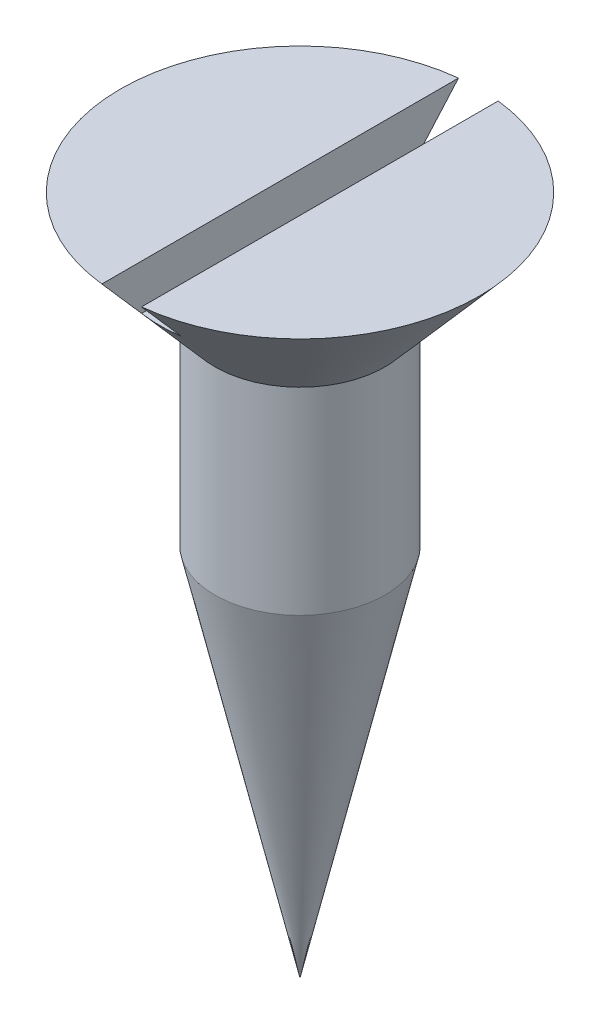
ISO-10303-21;
HEADER;
FILE_DESCRIPTION(('STEP AP214'),'2;1');
FILE_NAME('part.step','',(''),(''),'','','');
FILE_SCHEMA(('AUTOMOTIVE_DESIGN { 1 0 10303 214 1 1 1 1 }'));
ENDSEC;
DATA;
#1=APPLICATION_CONTEXT('core data for automotive mechanical design processes');
#2=APPLICATION_PROTOCOL_DEFINITION('international standard','automotive_design',2000,#1);
#3=PRODUCT_CONTEXT('',#1,'mechanical');
#4=PRODUCT('Part','Part','',(#3));
#5=PRODUCT_RELATED_PRODUCT_CATEGORY('part','',(#4));
#6=PRODUCT_DEFINITION_FORMATION('','',#4);
#7=PRODUCT_DEFINITION_CONTEXT('part definition',#1,'design');
#8=PRODUCT_DEFINITION('design','',#6,#7);
#9=PRODUCT_DEFINITION_SHAPE('','',#8);
#10=(LENGTH_UNIT() NAMED_UNIT(*) SI_UNIT(.MILLI.,.METRE.));
#11=(NAMED_UNIT(*) PLANE_ANGLE_UNIT() SI_UNIT($,.RADIAN.));
#12=(NAMED_UNIT(*) SI_UNIT($,.STERADIAN.) SOLID_ANGLE_UNIT());
#13=UNCERTAINTY_MEASURE_WITH_UNIT(LENGTH_MEASURE(1.E-05),#10,'distance_accuracy_value','');
#14=(GEOMETRIC_REPRESENTATION_CONTEXT(3) GLOBAL_UNCERTAINTY_ASSIGNED_CONTEXT((#13)) GLOBAL_UNIT_ASSIGNED_CONTEXT((#10,
#11,#12)) REPRESENTATION_CONTEXT('',''));
#15=CARTESIAN_POINT('',(0.,0.,0.));
#16=DIRECTION('',(0.,0.,1.));
#17=DIRECTION('',(1.,0.,0.));
#18=AXIS2_PLACEMENT_3D('',#15,#16,#17);
#19=CARTESIAN_POINT('',(-4.01955,0.,0.));
#20=DIRECTION('',(0.,1.,0.));
#21=DIRECTION('',(-1.,0.,0.));
#22=AXIS2_PLACEMENT_3D('',#19,#20,#21);
#23=PLANE('',#22);
#24=DIRECTION('',(0.,0.,-1.));
#25=VECTOR('',#24,1.);
#26=CARTESIAN_POINT('',(0.4445,0.,0.));
#27=LINE('',#26,#25);
#28=CARTESIAN_POINT('',(0.4445,0.,3.99489698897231));
#29=VERTEX_POINT('',#28);
#30=CARTESIAN_POINT('',(0.4445,0.,-3.99489698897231));
#31=VERTEX_POINT('',#30);
#32=EDGE_CURVE('E133',#29,#31,#27,.T.);
#33=ORIENTED_EDGE('',*,*,#32,.F.);
#34=CARTESIAN_POINT('',(0.,0.,0.));
#35=DIRECTION('',(0.,1.,0.));
#36=DIRECTION('',(-1.,0.,0.));
#37=AXIS2_PLACEMENT_3D('',#34,#35,#36);
#38=CIRCLE('',#37,4.01955);
#39=EDGE_CURVE('E134',#29,#31,#38,.T.);
#40=ORIENTED_EDGE('',*,*,#39,.T.);
#41=EDGE_LOOP('',(#33,#40));
#42=FACE_BOUND('',#41,.T.);
#43=ADVANCED_FACE('F32',(#42),#23,.T.);
#44=DIRECTION('',(0.,0.,1.));
#45=VECTOR('',#44,1.);
#46=CARTESIAN_POINT('',(-0.4445,0.,0.));
#47=LINE('',#46,#45);
#48=CARTESIAN_POINT('',(-0.4445,0.,-3.99489698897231));
#49=VERTEX_POINT('',#48);
#50=CARTESIAN_POINT('',(-0.4445,0.,3.99489698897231));
#51=VERTEX_POINT('',#50);
#52=EDGE_CURVE('E80',#49,#51,#47,.T.);
#53=ORIENTED_EDGE('',*,*,#52,.F.);
#54=EDGE_CURVE('E136',#49,#51,#38,.T.);
#55=ORIENTED_EDGE('',*,*,#54,.T.);
#56=EDGE_LOOP('',(#53,#55));
#57=FACE_BOUND('',#56,.T.);
#58=ADVANCED_FACE('F34',(#57),#23,.T.);
#59=CARTESIAN_POINT('',(0.,-6.858,0.));
#60=DIRECTION('',(0.,1.,0.));
#61=DIRECTION('',(-1.,0.,0.));
#62=AXIS2_PLACEMENT_3D('',#59,#60,#61);
#63=CONICAL_SURFACE('',#62,1.905,0.223476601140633);
#64=CARTESIAN_POINT('',(0.,-15.24,0.));
#65=VERTEX_POINT('',#64);
#66=VERTEX_LOOP('',#65);
#67=FACE_BOUND('',#66,.T.);
#68=CARTESIAN_POINT('',(0.,-6.858,0.));
#69=DIRECTION('',(0.,1.,0.));
#70=DIRECTION('',(-1.,0.,0.));
#71=AXIS2_PLACEMENT_3D('',#68,#69,#70);
#72=CIRCLE('',#71,1.905);
#73=CARTESIAN_POINT('',(-1.905,-6.858,0.));
#74=VERTEX_POINT('',#73);
#75=EDGE_CURVE('E100',#74,#74,#72,.T.);
#76=ORIENTED_EDGE('',*,*,#75,.F.);
#77=EDGE_LOOP('',(#76));
#78=FACE_BOUND('',#77,.T.);
#79=ADVANCED_FACE('F129',(#67,#78),#63,.T.);
#80=CARTESIAN_POINT('',(0.,0.,0.));
#81=DIRECTION('',(0.,1.,0.));
#82=DIRECTION('',(-1.,0.,0.));
#83=AXIS2_PLACEMENT_3D('',#80,#81,#82);
#84=CYLINDRICAL_SURFACE('',#83,1.905);
#85=ORIENTED_EDGE('',*,*,#75,.T.);
#86=EDGE_LOOP('',(#85));
#87=FACE_BOUND('',#86,.T.);
#88=CARTESIAN_POINT('',(0.,-2.43251151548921,0.));
#89=DIRECTION('',(0.,1.,0.));
#90=DIRECTION('',(-1.,0.,0.));
#91=AXIS2_PLACEMENT_3D('',#88,#89,#90);
#92=CIRCLE('',#91,1.905);
#93=CARTESIAN_POINT('',(-1.905,-2.43251151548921,0.));
#94=VERTEX_POINT('',#93);
#95=EDGE_CURVE('E102',#94,#94,#92,.T.);
#96=ORIENTED_EDGE('',*,*,#95,.F.);
#97=EDGE_LOOP('',(#96));
#98=FACE_BOUND('',#97,.T.);
#99=ADVANCED_FACE('F123',(#87,#98),#84,.T.);
#100=CARTESIAN_POINT('',(0.,0.,0.));
#101=DIRECTION('',(0.,1.,0.));
#102=DIRECTION('',(-1.,0.,0.));
#103=AXIS2_PLACEMENT_3D('',#100,#101,#102);
#104=CONICAL_SURFACE('',#103,4.01955,0.71558499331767);
#105=CARTESIAN_POINT('',(0.444499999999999,4.86202872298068,-8.23405807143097));
#106=CARTESIAN_POINT('',(0.444499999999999,4.54716209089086,-7.95994734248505));
#107=CARTESIAN_POINT('',(0.444499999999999,4.23231251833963,-7.68581701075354));
#108=CARTESIAN_POINT('',(0.444499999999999,3.60266623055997,-7.13749198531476));
#109=CARTESIAN_POINT('',(0.444499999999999,3.28786951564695,-6.86329729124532));
#110=CARTESIAN_POINT('',(0.444499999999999,2.65849958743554,-6.31495073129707));
#111=CARTESIAN_POINT('',(0.4445,2.34392633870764,-6.04079890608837));
#112=CARTESIAN_POINT('',(0.4445,1.71489416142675,-5.49236770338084));
#113=CARTESIAN_POINT('',(0.4445,1.40043523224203,-5.21808832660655));
#114=CARTESIAN_POINT('',(0.4445,0.775345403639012,-4.67251616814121));
#115=CARTESIAN_POINT('',(0.4445,0.464712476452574,-4.40122571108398));
#116=CARTESIAN_POINT('',(0.4445,-0.156261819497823,-3.85830112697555));
#117=CARTESIAN_POINT('',(0.4445,-0.466603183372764,-3.58666699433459));
#118=CARTESIAN_POINT('',(0.4445,-1.08690481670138,-3.04264665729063));
#119=CARTESIAN_POINT('',(0.4445,-1.39686481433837,-2.77026014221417));
#120=CARTESIAN_POINT('',(0.4445,-1.86082730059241,-2.36058529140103));
#121=CARTESIAN_POINT('',(0.4445,-2.01531548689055,-2.22384722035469));
#122=CARTESIAN_POINT('',(0.4445,-2.32373394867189,-1.94974373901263));
#123=CARTESIAN_POINT('',(0.4445,-2.47766422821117,-1.81237833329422));
#124=CARTESIAN_POINT('',(0.4445,-2.71169874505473,-1.60187950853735));
#125=CARTESIAN_POINT('',(0.4445,-2.79219314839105,-1.5291801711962));
#126=CARTESIAN_POINT('',(0.4445,-2.95273220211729,-1.38327405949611));
#127=CARTESIAN_POINT('',(0.4445,-3.0327768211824,-1.31006725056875));
#128=CARTESIAN_POINT('',(0.4445,-3.19206623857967,-1.16292215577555));
#129=CARTESIAN_POINT('',(0.4445,-3.27131165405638,-1.08898453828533));
#130=CARTESIAN_POINT('',(0.4445,-3.42854444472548,-0.939788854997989));
#131=CARTESIAN_POINT('',(0.444500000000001,-3.50653198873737,-0.864530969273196));
#132=CARTESIAN_POINT('',(0.444500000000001,-3.6215334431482,-0.749732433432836));
#133=CARTESIAN_POINT('',(0.444500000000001,-3.65951730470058,-0.711168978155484));
#134=CARTESIAN_POINT('',(0.444500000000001,-3.73450962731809,-0.633017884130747));
#135=CARTESIAN_POINT('',(0.444500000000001,-3.77151693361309,-0.593429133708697));
#136=CARTESIAN_POINT('',(0.444500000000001,-3.84384402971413,-0.512787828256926));
#137=CARTESIAN_POINT('',(0.444500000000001,-3.87916572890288,-0.471737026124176));
#138=CARTESIAN_POINT('',(0.444500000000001,-3.92982298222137,-0.408345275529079));
#139=CARTESIAN_POINT('',(0.444500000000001,-3.94630848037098,-0.386930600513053));
#140=CARTESIAN_POINT('',(0.444500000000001,-3.97816871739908,-0.343295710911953));
#141=CARTESIAN_POINT('',(0.444500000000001,-3.99354383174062,-0.321075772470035));
#142=CARTESIAN_POINT('',(0.444500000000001,-4.02829680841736,-0.266895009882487));
#143=CARTESIAN_POINT('',(0.444500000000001,-4.04695592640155,-0.234459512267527));
#144=CARTESIAN_POINT('',(0.444500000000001,-4.07880687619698,-0.167093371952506));
#145=CARTESIAN_POINT('',(0.444500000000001,-4.09204000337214,-0.132184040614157));
#146=CARTESIAN_POINT('',(0.444500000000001,-4.10633591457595,-0.0733681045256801));
#147=CARTESIAN_POINT('',(0.444500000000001,-4.1100854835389,-0.0501411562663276));
#148=CARTESIAN_POINT('',(0.444500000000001,-4.11331165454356,-0.00338498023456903));
#149=CARTESIAN_POINT('',(0.444500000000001,-4.11279049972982,0.0201440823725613));
#150=CARTESIAN_POINT('',(0.444500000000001,-4.10760050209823,0.0666114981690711));
#151=CARTESIAN_POINT('',(0.444500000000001,-4.10294920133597,0.089551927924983));
#152=CARTESIAN_POINT('',(0.444500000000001,-4.09032138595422,0.134498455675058));
#153=CARTESIAN_POINT('',(0.444500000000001,-4.0823388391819,0.156502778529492));
#154=CARTESIAN_POINT('',(0.444500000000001,-4.06120963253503,0.205929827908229));
#155=CARTESIAN_POINT('',(0.444500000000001,-4.04723168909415,0.232987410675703));
#156=CARTESIAN_POINT('',(0.444500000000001,-4.01671249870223,0.285638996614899));
#157=CARTESIAN_POINT('',(0.444500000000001,-4.00016554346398,0.31122956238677));
#158=CARTESIAN_POINT('',(0.444500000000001,-3.96529500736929,0.361471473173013));
#159=CARTESIAN_POINT('',(0.444500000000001,-3.94695772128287,0.386113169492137));
#160=CARTESIAN_POINT('',(0.444500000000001,-3.90920088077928,0.434499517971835));
#161=CARTESIAN_POINT('',(0.444500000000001,-3.88978251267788,0.458245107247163));
#162=CARTESIAN_POINT('',(0.444500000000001,-3.84804787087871,0.507612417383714));
#163=CARTESIAN_POINT('',(0.444500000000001,-3.82564488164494,0.533160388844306));
#164=CARTESIAN_POINT('',(0.444500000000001,-3.78018313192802,0.58366796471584));
#165=CARTESIAN_POINT('',(0.444500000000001,-3.75712428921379,0.608627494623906));
#166=CARTESIAN_POINT('',(0.444500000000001,-3.68722823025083,0.68286756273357));
#167=CARTESIAN_POINT('',(0.444500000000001,-3.63969102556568,0.731487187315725));
#168=CARTESIAN_POINT('',(0.444500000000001,-3.5434819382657,0.827747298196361));
#169=CARTESIAN_POINT('',(0.4445,-3.49480822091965,0.875385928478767));
#170=CARTESIAN_POINT('',(0.4445,-3.39680116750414,0.969952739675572));
#171=CARTESIAN_POINT('',(0.4445,-3.34746800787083,1.0168811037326));
#172=CARTESIAN_POINT('',(0.4445,-3.24853986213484,1.11008502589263));
#173=CARTESIAN_POINT('',(0.4445,-3.19894655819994,1.15636237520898));
#174=CARTESIAN_POINT('',(0.4445,-3.09944170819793,1.24857990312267));
#175=CARTESIAN_POINT('',(0.4445,-3.04953014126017,1.29452005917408));
#176=CARTESIAN_POINT('',(0.4445,-2.89955841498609,1.43187546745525));
#177=CARTESIAN_POINT('',(0.4445,-2.79915959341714,1.52292061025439));
#178=CARTESIAN_POINT('',(0.4445,-2.59822702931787,1.70408783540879));
#179=CARTESIAN_POINT('',(0.4445,-2.49769526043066,1.79421211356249));
#180=CARTESIAN_POINT('',(0.4445,-2.2962986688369,1.97408799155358));
#181=CARTESIAN_POINT('',(0.4445,-2.19543384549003,2.06383959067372));
#182=CARTESIAN_POINT('',(0.4445,-1.89250701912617,2.33272734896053));
#183=CARTESIAN_POINT('',(0.4445,-1.69011645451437,2.51149306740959));
#184=CARTESIAN_POINT('',(0.4445,-1.28480841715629,2.86859005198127));
#185=CARTESIAN_POINT('',(0.4445,-1.08189076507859,3.046921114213));
#186=CARTESIAN_POINT('',(0.4445,-0.675788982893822,3.40327607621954));
#187=CARTESIAN_POINT('',(0.4445,-0.472604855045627,3.58129997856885));
#188=CARTESIAN_POINT('',(0.4445,0.137350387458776,4.11522518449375));
#189=CARTESIAN_POINT('',(0.4445,0.544369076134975,4.47084354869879));
#190=CARTESIAN_POINT('',(0.4445,1.35866800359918,5.18168926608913));
#191=CARTESIAN_POINT('',(0.4445,1.76594820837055,5.53691665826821));
#192=CARTESIAN_POINT('',(0.4445,2.39733482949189,6.0873315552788));
#193=CARTESIAN_POINT('',(0.4445,2.6213795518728,6.28258982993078));
#194=CARTESIAN_POINT('',(0.444499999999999,3.06951630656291,6.67306528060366));
#195=CARTESIAN_POINT('',(0.444499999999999,3.29360834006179,6.86828245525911));
#196=CARTESIAN_POINT('',(0.444499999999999,3.74174430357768,7.25861171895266));
#197=CARTESIAN_POINT('',(0.444499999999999,3.96578822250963,7.45372382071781));
#198=CARTESIAN_POINT('',(0.444499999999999,4.41389453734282,7.84391356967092));
#199=CARTESIAN_POINT('',(0.444499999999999,4.63795693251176,8.03899121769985));
#200=CARTESIAN_POINT('',(0.444499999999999,4.86202872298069,8.23405807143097));
#201=B_SPLINE_CURVE_WITH_KNOTS('',3,(#105,#106,#107,#108,#109,#110,#111,#112,#113,#114,#115,
#116,#117,#118,#119,#120,#121,#122,#123,#124,#125,#126,#127,#128,#129,#130,#131,#132,#133,#134,
#135,#136,#137,#138,#139,#140,#141,#142,#143,#144,#145,#146,#147,#148,#149,#150,#151,#152,#153,
#154,#155,#156,#157,#158,#159,#160,#161,#162,#163,#164,#165,#166,#167,#168,#169,#170,#171,#172,
#173,#174,#175,#176,#177,#178,#179,#180,#181,#182,#183,#184,#185,#186,#187,#188,#189,#190,#191,
#192,#193,#194,#195,#196,#197,#198,#199,#200),.UNSPECIFIED.,.F.,.F.,(4,2,2,2,2,2,2,2,2,2,2,2,2,
2,2,2,2,2,2,2,2,2,2,2,2,2,2,2,2,2,2,2,2,2,2,2,2,2,2,2,2,2,2,2,2,2,2,4),(0.,1.25239738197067,
2.50480198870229,3.75661662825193,5.00842424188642,6.24568789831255,7.48297194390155,
8.72088120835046,9.33981126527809,9.95873681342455,10.2841291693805,10.6095439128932,
10.9346844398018,11.2597809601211,11.4221539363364,11.584711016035,11.7470793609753,
11.828129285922,11.9091516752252,12.0211684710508,12.1323161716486,12.2025532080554,
12.2727533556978,12.3426567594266,12.4126872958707,12.5038190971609,12.5951563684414,
12.6872577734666,12.7792600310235,12.8811816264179,12.983116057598,13.1870740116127,
13.3913877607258,13.5956478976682,13.7991399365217,14.0026454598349,14.4092392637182,
14.8142829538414,15.2193274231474,16.0294316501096,16.8398620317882,17.6502855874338,
19.2717528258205,20.8930402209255,21.7846098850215,22.676205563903,23.5674853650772,
24.4587390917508),.UNSPECIFIED.);
#202=CARTESIAN_POINT('',(0.4445,-1.016,3.10469650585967));
#203=VERTEX_POINT('',#202);
#204=EDGE_CURVE('E11',#203,#29,#201,.T.);
#205=ORIENTED_EDGE('',*,*,#204,.F.);
#206=CARTESIAN_POINT('',(0.,-1.016,0.));
#207=DIRECTION('',(0.,-1.,0.));
#208=DIRECTION('',(0.,0.,-1.));
#209=AXIS2_PLACEMENT_3D('',#206,#207,#208);
#210=CIRCLE('',#209,3.13635467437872);
#211=CARTESIAN_POINT('',(-0.4445,-1.016,3.10469650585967));
#212=VERTEX_POINT('',#211);
#213=EDGE_CURVE('E47',#212,#203,#210,.F.);
#214=ORIENTED_EDGE('',*,*,#213,.F.);
#215=CARTESIAN_POINT('',(-0.444500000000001,4.86202872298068,8.23405807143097));
#216=CARTESIAN_POINT('',(-0.444500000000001,4.54716209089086,7.95994734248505));
#217=CARTESIAN_POINT('',(-0.444500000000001,4.23231251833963,7.68581701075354));
#218=CARTESIAN_POINT('',(-0.444500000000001,3.60266623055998,7.13749198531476));
#219=CARTESIAN_POINT('',(-0.444500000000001,3.28786951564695,6.86329729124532));
#220=CARTESIAN_POINT('',(-0.444500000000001,2.65849958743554,6.31495073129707));
#221=CARTESIAN_POINT('',(-0.4445,2.34392633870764,6.04079890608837));
#222=CARTESIAN_POINT('',(-0.4445,1.71489416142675,5.49236770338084));
#223=CARTESIAN_POINT('',(-0.4445,1.40043523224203,5.21808832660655));
#224=CARTESIAN_POINT('',(-0.4445,0.775345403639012,4.67251616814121));
#225=CARTESIAN_POINT('',(-0.4445,0.464712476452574,4.40122571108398));
#226=CARTESIAN_POINT('',(-0.4445,-0.156261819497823,3.85830112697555));
#227=CARTESIAN_POINT('',(-0.4445,-0.466603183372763,3.58666699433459));
#228=CARTESIAN_POINT('',(-0.4445,-1.08690481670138,3.04264665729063));
#229=CARTESIAN_POINT('',(-0.4445,-1.39686481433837,2.77026014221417));
#230=CARTESIAN_POINT('',(-0.4445,-1.86082730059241,2.36058529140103));
#231=CARTESIAN_POINT('',(-0.4445,-2.01531548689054,2.22384722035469));
#232=CARTESIAN_POINT('',(-0.4445,-2.32373394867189,1.94974373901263));
#233=CARTESIAN_POINT('',(-0.4445,-2.47766422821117,1.81237833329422));
#234=CARTESIAN_POINT('',(-0.4445,-2.71169874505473,1.60187950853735));
#235=CARTESIAN_POINT('',(-0.4445,-2.79219314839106,1.5291801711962));
#236=CARTESIAN_POINT('',(-0.4445,-2.95273220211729,1.38327405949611));
#237=CARTESIAN_POINT('',(-0.4445,-3.0327768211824,1.31006725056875));
#238=CARTESIAN_POINT('',(-0.4445,-3.19206623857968,1.16292215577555));
#239=CARTESIAN_POINT('',(-0.4445,-3.27131165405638,1.08898453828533));
#240=CARTESIAN_POINT('',(-0.4445,-3.42854444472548,0.939788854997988));
#241=CARTESIAN_POINT('',(-0.4445,-3.50653198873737,0.864530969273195));
#242=CARTESIAN_POINT('',(-0.4445,-3.6215334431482,0.749732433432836));
#243=CARTESIAN_POINT('',(-0.4445,-3.65951730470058,0.711168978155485));
#244=CARTESIAN_POINT('',(-0.4445,-3.73450962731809,0.633017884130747));
#245=CARTESIAN_POINT('',(-0.4445,-3.77151693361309,0.593429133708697));
#246=CARTESIAN_POINT('',(-0.4445,-3.84384402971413,0.512787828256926));
#247=CARTESIAN_POINT('',(-0.4445,-3.87916572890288,0.471737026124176));
#248=CARTESIAN_POINT('',(-0.4445,-3.92982298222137,0.408345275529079));
#249=CARTESIAN_POINT('',(-0.4445,-3.94630848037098,0.386930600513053));
#250=CARTESIAN_POINT('',(-0.4445,-3.97816871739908,0.343295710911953));
#251=CARTESIAN_POINT('',(-0.4445,-3.99354383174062,0.321075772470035));
#252=CARTESIAN_POINT('',(-0.4445,-4.02829680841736,0.266895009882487));
#253=CARTESIAN_POINT('',(-0.4445,-4.04695592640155,0.234459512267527));
#254=CARTESIAN_POINT('',(-0.4445,-4.07880687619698,0.167093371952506));
#255=CARTESIAN_POINT('',(-0.4445,-4.09204000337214,0.132184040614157));
#256=CARTESIAN_POINT('',(-0.4445,-4.10633591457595,0.0733681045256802));
#257=CARTESIAN_POINT('',(-0.4445,-4.1100854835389,0.0501411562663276));
#258=CARTESIAN_POINT('',(-0.4445,-4.11331165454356,0.00338498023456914));
#259=CARTESIAN_POINT('',(-0.4445,-4.11279049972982,-0.0201440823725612));
#260=CARTESIAN_POINT('',(-0.4445,-4.10760050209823,-0.0666114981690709));
#261=CARTESIAN_POINT('',(-0.4445,-4.10294920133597,-0.0895519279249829));
#262=CARTESIAN_POINT('',(-0.4445,-4.09032138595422,-0.134498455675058));
#263=CARTESIAN_POINT('',(-0.4445,-4.0823388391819,-0.156502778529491));
#264=CARTESIAN_POINT('',(-0.4445,-4.06120963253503,-0.20592982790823));
#265=CARTESIAN_POINT('',(-0.4445,-4.04723168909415,-0.232987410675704));
#266=CARTESIAN_POINT('',(-0.4445,-4.01671249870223,-0.2856389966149));
#267=CARTESIAN_POINT('',(-0.4445,-4.00016554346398,-0.31122956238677));
#268=CARTESIAN_POINT('',(-0.4445,-3.96529500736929,-0.361471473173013));
#269=CARTESIAN_POINT('',(-0.4445,-3.94695772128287,-0.386113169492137));
#270=CARTESIAN_POINT('',(-0.4445,-3.90920088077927,-0.434499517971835));
#271=CARTESIAN_POINT('',(-0.4445,-3.88978251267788,-0.458245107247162));
#272=CARTESIAN_POINT('',(-0.4445,-3.84804787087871,-0.507612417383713));
#273=CARTESIAN_POINT('',(-0.4445,-3.82564488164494,-0.533160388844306));
#274=CARTESIAN_POINT('',(-0.4445,-3.78018313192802,-0.583667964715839));
#275=CARTESIAN_POINT('',(-0.4445,-3.75712428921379,-0.608627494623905));
#276=CARTESIAN_POINT('',(-0.4445,-3.68722823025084,-0.682867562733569));
#277=CARTESIAN_POINT('',(-0.4445,-3.63969102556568,-0.731487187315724));
#278=CARTESIAN_POINT('',(-0.4445,-3.54348193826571,-0.82774729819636));
#279=CARTESIAN_POINT('',(-0.4445,-3.49480822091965,-0.875385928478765));
#280=CARTESIAN_POINT('',(-0.4445,-3.39680116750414,-0.969952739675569));
#281=CARTESIAN_POINT('',(-0.4445,-3.34746800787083,-1.0168811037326));
#282=CARTESIAN_POINT('',(-0.4445,-3.24853986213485,-1.11008502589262));
#283=CARTESIAN_POINT('',(-0.4445,-3.19894655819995,-1.15636237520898));
#284=CARTESIAN_POINT('',(-0.4445,-3.09944170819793,-1.24857990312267));
#285=CARTESIAN_POINT('',(-0.4445,-3.04953014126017,-1.29452005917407));
#286=CARTESIAN_POINT('',(-0.4445,-2.89955841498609,-1.43187546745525));
#287=CARTESIAN_POINT('',(-0.4445,-2.79915959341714,-1.52292061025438));
#288=CARTESIAN_POINT('',(-0.4445,-2.59822702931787,-1.70408783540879));
#289=CARTESIAN_POINT('',(-0.4445,-2.49769526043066,-1.79421211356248));
#290=CARTESIAN_POINT('',(-0.4445,-2.2962986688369,-1.97408799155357));
#291=CARTESIAN_POINT('',(-0.4445,-2.19543384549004,-2.06383959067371));
#292=CARTESIAN_POINT('',(-0.4445,-1.89250701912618,-2.33272734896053));
#293=CARTESIAN_POINT('',(-0.4445,-1.69011645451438,-2.51149306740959));
#294=CARTESIAN_POINT('',(-0.4445,-1.2848084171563,-2.86859005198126));
#295=CARTESIAN_POINT('',(-0.4445,-1.0818907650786,-3.04692111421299));
#296=CARTESIAN_POINT('',(-0.4445,-0.675788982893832,-3.40327607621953));
#297=CARTESIAN_POINT('',(-0.4445,-0.472604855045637,-3.58129997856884));
#298=CARTESIAN_POINT('',(-0.4445,0.137350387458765,-4.11522518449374));
#299=CARTESIAN_POINT('',(-0.4445,0.544369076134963,-4.47084354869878));
#300=CARTESIAN_POINT('',(-0.4445,1.35866800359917,-5.18168926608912));
#301=CARTESIAN_POINT('',(-0.4445,1.76594820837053,-5.53691665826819));
#302=CARTESIAN_POINT('',(-0.444500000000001,2.39733482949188,-6.08733155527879));
#303=CARTESIAN_POINT('',(-0.444500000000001,2.62137955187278,-6.28258982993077));
#304=CARTESIAN_POINT('',(-0.444500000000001,3.06951630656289,-6.67306528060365));
#305=CARTESIAN_POINT('',(-0.444500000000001,3.29360834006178,-6.8682824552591));
#306=CARTESIAN_POINT('',(-0.444500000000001,3.74174430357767,-7.25861171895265));
#307=CARTESIAN_POINT('',(-0.444500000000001,3.96578822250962,-7.45372382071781));
#308=CARTESIAN_POINT('',(-0.444500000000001,4.41389453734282,-7.84391356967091));
#309=CARTESIAN_POINT('',(-0.444500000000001,4.63795693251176,-8.03899121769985));
#310=CARTESIAN_POINT('',(-0.444500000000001,4.86202872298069,-8.23405807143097));
#311=B_SPLINE_CURVE_WITH_KNOTS('',3,(#215,#216,#217,#218,#219,#220,#221,#222,#223,#224,#225,
#226,#227,#228,#229,#230,#231,#232,#233,#234,#235,#236,#237,#238,#239,#240,#241,#242,#243,#244,
#245,#246,#247,#248,#249,#250,#251,#252,#253,#254,#255,#256,#257,#258,#259,#260,#261,#262,#263,
#264,#265,#266,#267,#268,#269,#270,#271,#272,#273,#274,#275,#276,#277,#278,#279,#280,#281,#282,
#283,#284,#285,#286,#287,#288,#289,#290,#291,#292,#293,#294,#295,#296,#297,#298,#299,#300,#301,
#302,#303,#304,#305,#306,#307,#308,#309,#310),.UNSPECIFIED.,.F.,.F.,(4,2,2,2,2,2,2,2,2,2,2,2,2,
2,2,2,2,2,2,2,2,2,2,2,2,2,2,2,2,2,2,2,2,2,2,2,2,2,2,2,2,2,2,2,2,2,2,4),(0.,1.25239738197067,
2.50480198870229,3.75661662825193,5.00842424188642,6.24568789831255,7.48297194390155,
8.72088120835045,9.33981126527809,9.95873681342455,10.2841291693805,10.6095439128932,
10.9346844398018,11.2597809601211,11.4221539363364,11.584711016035,11.7470793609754,
11.828129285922,11.9091516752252,12.0211684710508,12.1323161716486,12.2025532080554,
12.2727533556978,12.3426567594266,12.4126872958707,12.5038190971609,12.5951563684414,
12.6872577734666,12.7792600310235,12.8811816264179,12.983116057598,13.1870740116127,
13.3913877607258,13.5956478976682,13.7991399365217,14.0026454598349,14.4092392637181,
14.8142829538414,15.2193274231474,16.0294316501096,16.8398620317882,17.6502855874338,
19.2717528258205,20.8930402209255,21.7846098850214,22.676205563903,23.5674853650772,
24.4587390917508),.UNSPECIFIED.);
#312=EDGE_CURVE('E77',#51,#212,#311,.T.);
#313=ORIENTED_EDGE('',*,*,#312,.F.);
#314=ORIENTED_EDGE('',*,*,#54,.F.);
#315=CARTESIAN_POINT('',(-0.4445,-1.016,-3.10469650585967));
#316=VERTEX_POINT('',#315);
#317=EDGE_CURVE('E86',#316,#49,#311,.T.);
#318=ORIENTED_EDGE('',*,*,#317,.F.);
#319=CARTESIAN_POINT('',(0.4445,-1.016,-3.10469650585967));
#320=VERTEX_POINT('',#319);
#321=EDGE_CURVE('E92',#320,#316,#210,.F.);
#322=ORIENTED_EDGE('',*,*,#321,.F.);
#323=EDGE_CURVE('E36',#31,#320,#201,.T.);
#324=ORIENTED_EDGE('',*,*,#323,.F.);
#325=ORIENTED_EDGE('',*,*,#39,.F.);
#326=EDGE_LOOP('',(#205,#214,#313,#314,#318,#322,#324,#325));
#327=FACE_BOUND('',#326,.T.);
#328=ORIENTED_EDGE('',*,*,#95,.T.);
#329=EDGE_LOOP('',(#328));
#330=FACE_BOUND('',#329,.T.);
#331=ADVANCED_FACE('F97',(#327,#330),#104,.T.);
#332=CARTESIAN_POINT('',(0.4445,1.016,-4.01955));
#333=DIRECTION('',(1.,0.,0.));
#334=DIRECTION('',(0.,1.,0.));
#335=AXIS2_PLACEMENT_3D('',#332,#333,#334);
#336=PLANE('',#335);
#337=ORIENTED_EDGE('',*,*,#323,.T.);
#338=DIRECTION('',(0.,0.,1.));
#339=VECTOR('',#338,1.);
#340=CARTESIAN_POINT('',(0.4445,-1.016,-4.01955));
#341=LINE('',#340,#339);
#342=EDGE_CURVE('E94',#320,#203,#341,.T.);
#343=ORIENTED_EDGE('',*,*,#342,.T.);
#344=ORIENTED_EDGE('',*,*,#204,.T.);
#345=ORIENTED_EDGE('',*,*,#32,.T.);
#346=EDGE_LOOP('',(#337,#343,#344,#345));
#347=FACE_BOUND('',#346,.T.);
#348=ADVANCED_FACE('F115',(#347),#336,.F.);
#349=CARTESIAN_POINT('',(-0.4445,-1.016,-4.01955));
#350=DIRECTION('',(0.,-1.,0.));
#351=DIRECTION('',(0.,0.,-1.));
#352=AXIS2_PLACEMENT_3D('',#349,#350,#351);
#353=PLANE('',#352);
#354=ORIENTED_EDGE('',*,*,#213,.T.);
#355=ORIENTED_EDGE('',*,*,#342,.F.);
#356=ORIENTED_EDGE('',*,*,#321,.T.);
#357=DIRECTION('',(0.,0.,1.));
#358=VECTOR('',#357,1.);
#359=CARTESIAN_POINT('',(-0.4445,-1.016,-4.01955));
#360=LINE('',#359,#358);
#361=EDGE_CURVE('E54',#316,#212,#360,.T.);
#362=ORIENTED_EDGE('',*,*,#361,.T.);
#363=EDGE_LOOP('',(#354,#355,#356,#362));
#364=FACE_BOUND('',#363,.T.);
#365=ADVANCED_FACE('F88',(#364),#353,.F.);
#366=CARTESIAN_POINT('',(-0.4445,1.016,-4.01955));
#367=DIRECTION('',(-1.,0.,0.));
#368=DIRECTION('',(0.,-1.,0.));
#369=AXIS2_PLACEMENT_3D('',#366,#367,#368);
#370=PLANE('',#369);
#371=ORIENTED_EDGE('',*,*,#312,.T.);
#372=ORIENTED_EDGE('',*,*,#361,.F.);
#373=ORIENTED_EDGE('',*,*,#317,.T.);
#374=ORIENTED_EDGE('',*,*,#52,.T.);
#375=EDGE_LOOP('',(#371,#372,#373,#374));
#376=FACE_BOUND('',#375,.T.);
#377=ADVANCED_FACE('F78',(#376),#370,.F.);
#378=CLOSED_SHELL('',(#43,#58,#79,#99,#331,#348,#365,#377));
#379=MANIFOLD_SOLID_BREP('B2',#378);
#380=ADVANCED_BREP_SHAPE_REPRESENTATION('',(#18,#379),#14);
#381=SHAPE_DEFINITION_REPRESENTATION(#9,#380);
ENDSEC;
END-ISO-10303-21;
